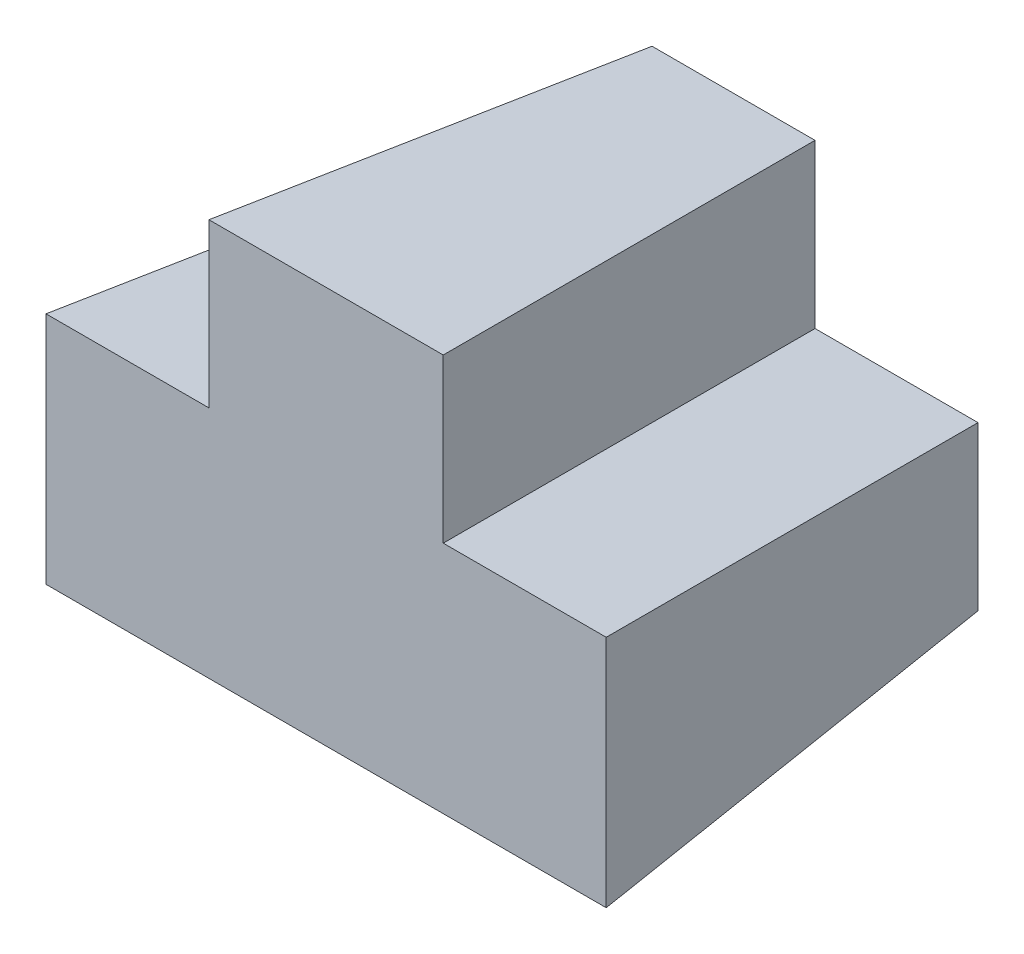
ISO-10303-21;
HEADER;
FILE_DESCRIPTION(('STEP AP214'),'2;1');
FILE_NAME('part.step','',(''),(''),'','','');
FILE_SCHEMA(('AUTOMOTIVE_DESIGN { 1 0 10303 214 1 1 1 1 }'));
ENDSEC;
DATA;
#1=APPLICATION_CONTEXT('core data for automotive mechanical design processes');
#2=APPLICATION_PROTOCOL_DEFINITION('international standard','automotive_design',2000,#1);
#3=PRODUCT_CONTEXT('',#1,'mechanical');
#4=PRODUCT('Part','Part','',(#3));
#5=PRODUCT_RELATED_PRODUCT_CATEGORY('part','',(#4));
#6=PRODUCT_DEFINITION_FORMATION('','',#4);
#7=PRODUCT_DEFINITION_CONTEXT('part definition',#1,'design');
#8=PRODUCT_DEFINITION('design','',#6,#7);
#9=PRODUCT_DEFINITION_SHAPE('','',#8);
#10=(LENGTH_UNIT() NAMED_UNIT(*) SI_UNIT(.MILLI.,.METRE.));
#11=(NAMED_UNIT(*) PLANE_ANGLE_UNIT() SI_UNIT($,.RADIAN.));
#12=(NAMED_UNIT(*) SI_UNIT($,.STERADIAN.) SOLID_ANGLE_UNIT());
#13=UNCERTAINTY_MEASURE_WITH_UNIT(LENGTH_MEASURE(1.E-05),#10,'distance_accuracy_value','');
#14=(GEOMETRIC_REPRESENTATION_CONTEXT(3) GLOBAL_UNCERTAINTY_ASSIGNED_CONTEXT((#13)) GLOBAL_UNIT_ASSIGNED_CONTEXT((#10,
#11,#12)) REPRESENTATION_CONTEXT('',''));
#15=CARTESIAN_POINT('',(0.,0.,0.));
#16=DIRECTION('',(0.,0.,1.));
#17=DIRECTION('',(1.,0.,0.));
#18=AXIS2_PLACEMENT_3D('',#15,#16,#17);
#19=CARTESIAN_POINT('',(-12.,8.,0.));
#20=DIRECTION('',(0.,0.996194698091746,-0.0871557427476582));
#21=DIRECTION('',(0.,0.0871557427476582,0.996194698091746));
#22=AXIS2_PLACEMENT_3D('',#19,#20,#21);
#23=PLANE('',#22);
#24=DIRECTION('',(-1.,0.,0.));
#25=VECTOR('',#24,1.);
#26=CARTESIAN_POINT('',(-12.,8.,0.));
#27=LINE('',#26,#25);
#28=CARTESIAN_POINT('',(-4.,8.,0.));
#29=VERTEX_POINT('',#28);
#30=CARTESIAN_POINT('',(-12.,8.,0.));
#31=VERTEX_POINT('',#30);
#32=EDGE_CURVE('E103',#29,#31,#27,.T.);
#33=ORIENTED_EDGE('',*,*,#32,.T.);
#34=DIRECTION('',(0.0868265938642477,-0.0868265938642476,-0.992432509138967));
#35=VECTOR('',#34,1.);
#36=CARTESIAN_POINT('',(-11.9396891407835,7.93968914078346,-0.689356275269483));
#37=LINE('',#36,#35);
#38=CARTESIAN_POINT('',(-13.7497732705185,9.74977327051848,20.));
#39=VERTEX_POINT('',#38);
#40=EDGE_CURVE('E11',#39,#31,#37,.T.);
#41=ORIENTED_EDGE('',*,*,#40,.F.);
#42=DIRECTION('',(1.,0.,0.));
#43=VECTOR('',#42,1.);
#44=CARTESIAN_POINT('',(-12.,9.74977327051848,20.));
#45=LINE('',#44,#43);
#46=CARTESIAN_POINT('',(-5.74977327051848,9.74977327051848,20.));
#47=VERTEX_POINT('',#46);
#48=EDGE_CURVE('E128',#47,#39,#45,.F.);
#49=ORIENTED_EDGE('',*,*,#48,.F.);
#50=DIRECTION('',(0.0868265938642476,-0.0868265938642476,-0.992432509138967));
#51=VECTOR('',#50,1.);
#52=CARTESIAN_POINT('',(-4.,8.,0.));
#53=LINE('',#52,#51);
#54=EDGE_CURVE('E115',#47,#29,#53,.T.);
#55=ORIENTED_EDGE('',*,*,#54,.T.);
#56=EDGE_LOOP('',(#33,#41,#49,#55));
#57=FACE_BOUND('',#56,.T.);
#58=ADVANCED_FACE('F33',(#57),#23,.T.);
#59=CARTESIAN_POINT('',(-12.,0.,0.));
#60=DIRECTION('',(-0.996194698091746,0.,-0.0871557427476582));
#61=DIRECTION('',(-0.0871557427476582,0.,0.996194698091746));
#62=AXIS2_PLACEMENT_3D('',#59,#60,#61);
#63=PLANE('',#62);
#64=DIRECTION('',(0.,-1.,0.));
#65=VECTOR('',#64,1.);
#66=CARTESIAN_POINT('',(-12.,0.,0.));
#67=LINE('',#66,#65);
#68=CARTESIAN_POINT('',(-12.,0.,0.));
#69=VERTEX_POINT('',#68);
#70=EDGE_CURVE('E99',#31,#69,#67,.T.);
#71=ORIENTED_EDGE('',*,*,#70,.T.);
#72=DIRECTION('',(0.0868265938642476,0.0868265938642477,-0.992432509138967));
#73=VECTOR('',#72,1.);
#74=CARTESIAN_POINT('',(-11.8190674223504,0.180932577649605,-2.06806882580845));
#75=LINE('',#74,#73);
#76=CARTESIAN_POINT('',(-13.7497732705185,-1.74977327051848,20.));
#77=VERTEX_POINT('',#76);
#78=EDGE_CURVE('E42',#77,#69,#75,.T.);
#79=ORIENTED_EDGE('',*,*,#78,.F.);
#80=DIRECTION('',(0.,1.,0.));
#81=VECTOR('',#80,1.);
#82=CARTESIAN_POINT('',(-13.7497732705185,0.,20.));
#83=LINE('',#82,#81);
#84=EDGE_CURVE('E111',#39,#77,#83,.F.);
#85=ORIENTED_EDGE('',*,*,#84,.F.);
#86=ORIENTED_EDGE('',*,*,#40,.T.);
#87=EDGE_LOOP('',(#71,#79,#85,#86));
#88=FACE_BOUND('',#87,.T.);
#89=ADVANCED_FACE('F35',(#88),#63,.T.);
#90=CARTESIAN_POINT('',(12.,0.,0.));
#91=DIRECTION('',(0.,-0.996194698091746,-0.0871557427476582));
#92=DIRECTION('',(0.,0.0871557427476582,-0.996194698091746));
#93=AXIS2_PLACEMENT_3D('',#90,#91,#92);
#94=PLANE('',#93);
#95=DIRECTION('',(1.,0.,0.));
#96=VECTOR('',#95,1.);
#97=CARTESIAN_POINT('',(12.,0.,0.));
#98=LINE('',#97,#96);
#99=CARTESIAN_POINT('',(12.,0.,0.));
#100=VERTEX_POINT('',#99);
#101=EDGE_CURVE('E105',#69,#100,#98,.T.);
#102=ORIENTED_EDGE('',*,*,#101,.T.);
#103=DIRECTION('',(-0.0868265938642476,0.0868265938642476,-0.992432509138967));
#104=VECTOR('',#103,1.);
#105=CARTESIAN_POINT('',(11.9396891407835,0.0603108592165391,-0.689356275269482));
#106=LINE('',#105,#104);
#107=CARTESIAN_POINT('',(13.7497732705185,-1.74977327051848,20.));
#108=VERTEX_POINT('',#107);
#109=EDGE_CURVE('E143',#108,#100,#106,.T.);
#110=ORIENTED_EDGE('',*,*,#109,.F.);
#111=DIRECTION('',(-1.,0.,0.));
#112=VECTOR('',#111,1.);
#113=CARTESIAN_POINT('',(12.,-1.74977327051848,20.));
#114=LINE('',#113,#112);
#115=EDGE_CURVE('E149',#77,#108,#114,.F.);
#116=ORIENTED_EDGE('',*,*,#115,.F.);
#117=ORIENTED_EDGE('',*,*,#78,.T.);
#118=EDGE_LOOP('',(#102,#110,#116,#117));
#119=FACE_BOUND('',#118,.T.);
#120=ADVANCED_FACE('F172',(#119),#94,.T.);
#121=CARTESIAN_POINT('',(12.,8.,0.));
#122=DIRECTION('',(0.996194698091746,0.,-0.0871557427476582));
#123=DIRECTION('',(-0.0871557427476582,0.,-0.996194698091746));
#124=AXIS2_PLACEMENT_3D('',#121,#122,#123);
#125=PLANE('',#124);
#126=DIRECTION('',(0.,1.,0.));
#127=VECTOR('',#126,1.);
#128=CARTESIAN_POINT('',(12.,8.,0.));
#129=LINE('',#128,#127);
#130=CARTESIAN_POINT('',(12.,8.,0.));
#131=VERTEX_POINT('',#130);
#132=EDGE_CURVE('E119',#100,#131,#129,.T.);
#133=ORIENTED_EDGE('',*,*,#132,.T.);
#134=DIRECTION('',(-0.0868265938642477,-0.0868265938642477,-0.992432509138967));
#135=VECTOR('',#134,1.);
#136=CARTESIAN_POINT('',(11.9396891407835,7.93968914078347,-0.689356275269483));
#137=LINE('',#136,#135);
#138=CARTESIAN_POINT('',(13.7497732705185,9.74977327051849,20.));
#139=VERTEX_POINT('',#138);
#140=EDGE_CURVE('E140',#139,#131,#137,.T.);
#141=ORIENTED_EDGE('',*,*,#140,.F.);
#142=DIRECTION('',(0.,-1.,0.));
#143=VECTOR('',#142,1.);
#144=CARTESIAN_POINT('',(13.7497732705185,8.,20.));
#145=LINE('',#144,#143);
#146=EDGE_CURVE('E151',#108,#139,#145,.F.);
#147=ORIENTED_EDGE('',*,*,#146,.F.);
#148=ORIENTED_EDGE('',*,*,#109,.T.);
#149=EDGE_LOOP('',(#133,#141,#147,#148));
#150=FACE_BOUND('',#149,.T.);
#151=ADVANCED_FACE('F176',(#150),#125,.T.);
#152=CARTESIAN_POINT('',(4.,8.,0.));
#153=DIRECTION('',(0.,0.996194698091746,-0.0871557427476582));
#154=DIRECTION('',(0.,0.0871557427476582,0.996194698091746));
#155=AXIS2_PLACEMENT_3D('',#152,#153,#154);
#156=PLANE('',#155);
#157=DIRECTION('',(-1.,0.,0.));
#158=VECTOR('',#157,1.);
#159=CARTESIAN_POINT('',(4.,8.,0.));
#160=LINE('',#159,#158);
#161=CARTESIAN_POINT('',(4.,8.,0.));
#162=VERTEX_POINT('',#161);
#163=EDGE_CURVE('E121',#131,#162,#160,.T.);
#164=ORIENTED_EDGE('',*,*,#163,.T.);
#165=DIRECTION('',(-0.0868265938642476,-0.0868265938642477,-0.992432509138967));
#166=VECTOR('',#165,1.);
#167=CARTESIAN_POINT('',(4.,8.,0.));
#168=LINE('',#167,#166);
#169=CARTESIAN_POINT('',(5.74977327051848,9.74977327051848,20.));
#170=VERTEX_POINT('',#169);
#171=EDGE_CURVE('E137',#170,#162,#168,.T.);
#172=ORIENTED_EDGE('',*,*,#171,.F.);
#173=DIRECTION('',(1.,0.,0.));
#174=VECTOR('',#173,1.);
#175=CARTESIAN_POINT('',(4.,9.74977327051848,20.));
#176=LINE('',#175,#174);
#177=EDGE_CURVE('E153',#139,#170,#176,.F.);
#178=ORIENTED_EDGE('',*,*,#177,.F.);
#179=ORIENTED_EDGE('',*,*,#140,.T.);
#180=EDGE_LOOP('',(#164,#172,#178,#179));
#181=FACE_BOUND('',#180,.T.);
#182=ADVANCED_FACE('F179',(#181),#156,.T.);
#183=CARTESIAN_POINT('',(3.99999999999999,16.,0.));
#184=DIRECTION('',(0.996194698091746,0.,-0.0871557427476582));
#185=DIRECTION('',(-0.0871557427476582,0.,-0.996194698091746));
#186=AXIS2_PLACEMENT_3D('',#183,#184,#185);
#187=PLANE('',#186);
#188=DIRECTION('',(0.,1.,0.));
#189=VECTOR('',#188,1.);
#190=CARTESIAN_POINT('',(3.99999999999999,16.,0.));
#191=LINE('',#190,#189);
#192=CARTESIAN_POINT('',(3.99999999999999,16.,0.));
#193=VERTEX_POINT('',#192);
#194=EDGE_CURVE('E123',#162,#193,#191,.T.);
#195=ORIENTED_EDGE('',*,*,#194,.T.);
#196=DIRECTION('',(-0.0868265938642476,-0.0868265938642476,-0.992432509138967));
#197=VECTOR('',#196,1.);
#198=CARTESIAN_POINT('',(3.93968914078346,15.9396891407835,-0.689356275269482));
#199=LINE('',#198,#197);
#200=CARTESIAN_POINT('',(5.74977327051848,17.7497732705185,20.));
#201=VERTEX_POINT('',#200);
#202=EDGE_CURVE('E134',#201,#193,#199,.T.);
#203=ORIENTED_EDGE('',*,*,#202,.F.);
#204=DIRECTION('',(0.,-1.,0.));
#205=VECTOR('',#204,1.);
#206=CARTESIAN_POINT('',(5.74977327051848,16.,20.));
#207=LINE('',#206,#205);
#208=EDGE_CURVE('E155',#170,#201,#207,.F.);
#209=ORIENTED_EDGE('',*,*,#208,.F.);
#210=ORIENTED_EDGE('',*,*,#171,.T.);
#211=EDGE_LOOP('',(#195,#203,#209,#210));
#212=FACE_BOUND('',#211,.T.);
#213=ADVANCED_FACE('F162',(#212),#187,.T.);
#214=CARTESIAN_POINT('',(-4.,16.,0.));
#215=DIRECTION('',(0.,0.996194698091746,-0.0871557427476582));
#216=DIRECTION('',(0.,0.0871557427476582,0.996194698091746));
#217=AXIS2_PLACEMENT_3D('',#214,#215,#216);
#218=PLANE('',#217);
#219=DIRECTION('',(-1.,0.,0.));
#220=VECTOR('',#219,1.);
#221=CARTESIAN_POINT('',(-4.,16.,0.));
#222=LINE('',#221,#220);
#223=CARTESIAN_POINT('',(-4.,16.,0.));
#224=VERTEX_POINT('',#223);
#225=EDGE_CURVE('E125',#193,#224,#222,.T.);
#226=ORIENTED_EDGE('',*,*,#225,.T.);
#227=DIRECTION('',(0.0868265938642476,-0.0868265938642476,-0.992432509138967));
#228=VECTOR('',#227,1.);
#229=CARTESIAN_POINT('',(-3.93968914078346,15.9396891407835,-0.689356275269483));
#230=LINE('',#229,#228);
#231=CARTESIAN_POINT('',(-5.74977327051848,17.7497732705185,20.));
#232=VERTEX_POINT('',#231);
#233=EDGE_CURVE('E131',#232,#224,#230,.T.);
#234=ORIENTED_EDGE('',*,*,#233,.F.);
#235=DIRECTION('',(1.,0.,0.));
#236=VECTOR('',#235,1.);
#237=CARTESIAN_POINT('',(-4.,17.7497732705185,20.));
#238=LINE('',#237,#236);
#239=EDGE_CURVE('E54',#201,#232,#238,.F.);
#240=ORIENTED_EDGE('',*,*,#239,.F.);
#241=ORIENTED_EDGE('',*,*,#202,.T.);
#242=EDGE_LOOP('',(#226,#234,#240,#241));
#243=FACE_BOUND('',#242,.T.);
#244=ADVANCED_FACE('F166',(#243),#218,.T.);
#245=CARTESIAN_POINT('',(-4.,8.,0.));
#246=DIRECTION('',(-0.996194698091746,0.,-0.0871557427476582));
#247=DIRECTION('',(-0.0871557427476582,0.,0.996194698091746));
#248=AXIS2_PLACEMENT_3D('',#245,#246,#247);
#249=PLANE('',#248);
#250=DIRECTION('',(0.,-1.,0.));
#251=VECTOR('',#250,1.);
#252=CARTESIAN_POINT('',(-4.,8.,0.));
#253=LINE('',#252,#251);
#254=EDGE_CURVE('E127',#224,#29,#253,.T.);
#255=ORIENTED_EDGE('',*,*,#254,.T.);
#256=ORIENTED_EDGE('',*,*,#54,.F.);
#257=DIRECTION('',(0.,1.,0.));
#258=VECTOR('',#257,1.);
#259=CARTESIAN_POINT('',(-5.74977327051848,8.,20.));
#260=LINE('',#259,#258);
#261=EDGE_CURVE('E37',#232,#47,#260,.F.);
#262=ORIENTED_EDGE('',*,*,#261,.F.);
#263=ORIENTED_EDGE('',*,*,#233,.T.);
#264=EDGE_LOOP('',(#255,#256,#262,#263));
#265=FACE_BOUND('',#264,.T.);
#266=ADVANCED_FACE('F168',(#265),#249,.T.);
#267=CARTESIAN_POINT('',(0.,0.,20.));
#268=DIRECTION('',(0.,0.,1.));
#269=DIRECTION('',(1.,0.,0.));
#270=AXIS2_PLACEMENT_3D('',#267,#268,#269);
#271=PLANE('',#270);
#272=ORIENTED_EDGE('',*,*,#48,.T.);
#273=ORIENTED_EDGE('',*,*,#84,.T.);
#274=ORIENTED_EDGE('',*,*,#115,.T.);
#275=ORIENTED_EDGE('',*,*,#146,.T.);
#276=ORIENTED_EDGE('',*,*,#177,.T.);
#277=ORIENTED_EDGE('',*,*,#208,.T.);
#278=ORIENTED_EDGE('',*,*,#239,.T.);
#279=ORIENTED_EDGE('',*,*,#261,.T.);
#280=EDGE_LOOP('',(#272,#273,#274,#275,#276,#277,#278,#279));
#281=FACE_BOUND('',#280,.T.);
#282=ADVANCED_FACE('F158',(#281),#271,.T.);
#283=CARTESIAN_POINT('',(0.,0.,0.));
#284=DIRECTION('',(0.,0.,1.));
#285=DIRECTION('',(1.,0.,0.));
#286=AXIS2_PLACEMENT_3D('',#283,#284,#285);
#287=PLANE('',#286);
#288=ORIENTED_EDGE('',*,*,#32,.F.);
#289=ORIENTED_EDGE('',*,*,#254,.F.);
#290=ORIENTED_EDGE('',*,*,#225,.F.);
#291=ORIENTED_EDGE('',*,*,#194,.F.);
#292=ORIENTED_EDGE('',*,*,#163,.F.);
#293=ORIENTED_EDGE('',*,*,#132,.F.);
#294=ORIENTED_EDGE('',*,*,#101,.F.);
#295=ORIENTED_EDGE('',*,*,#70,.F.);
#296=EDGE_LOOP('',(#288,#289,#290,#291,#292,#293,#294,#295));
#297=FACE_BOUND('',#296,.T.);
#298=ADVANCED_FACE('F100',(#297),#287,.F.);
#299=CLOSED_SHELL('',(#58,#89,#120,#151,#182,#213,#244,#266,#282,#298));
#300=MANIFOLD_SOLID_BREP('B2',#299);
#301=ADVANCED_BREP_SHAPE_REPRESENTATION('',(#18,#300),#14);
#302=SHAPE_DEFINITION_REPRESENTATION(#9,#301);
ENDSEC;
END-ISO-10303-21;
